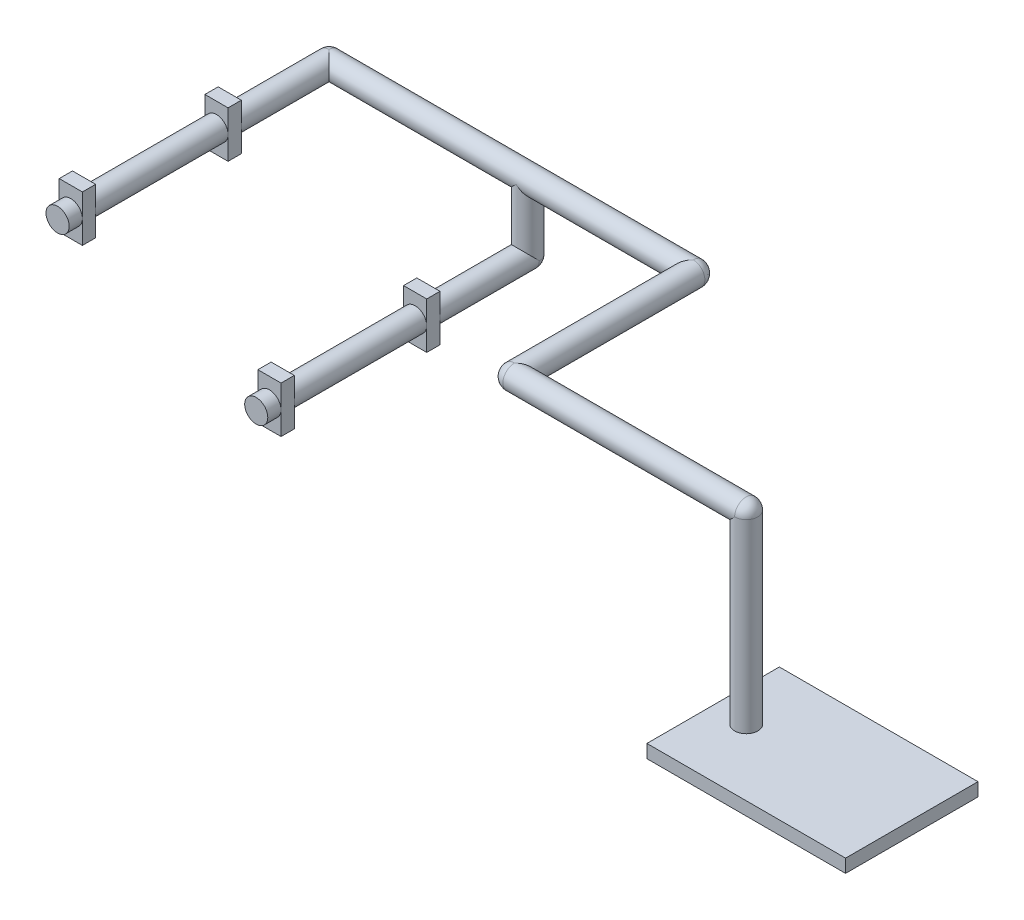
from build123d import *

# Parameters (mm, degrees)
EXTRUSION1_DEPTH      = 50
EXTRUSION1_DEPTH_BACK = 60
ESQUISSE1_R           = 3.5
ESQUISSE2_R           = 3.5
EXTRUSION2_DEPTH      = 20
ESQUISSE3_R           = 3.500016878
EXTRUSION3_DEPTH      = 30
ESQUISSE4_R           = 3.5
EXTRUSION4_DEPTH      = 30
ESQUISSE5_W           = 7
ESQUISSE5_H           = 14
EXTRUSION5_DEPTH      = 4
ESQUISSE6_R           = 3.5
EXTRUSION6_DEPTH      = 40
EXTRUSION7_DEPTH      = 4
ESQUISSE8_R           = 3.5
EXTRUSION8_DEPTH      = 4
ESQUISSE9_W           = 7
ESQUISSE9_H           = 14
EXTRUSION9_DEPTH      = 4
ESQUISSE10_R          = 3.489147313
EXTRUSION10_DEPTH     = 40
ESQUISSE11_W          = 7
ESQUISSE11_H          = 14
EXTRUSION11_DEPTH     = 4
ESQUISSE12_R          = 3.489147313
EXTRUSION12_DEPTH     = 4
ESQUISSE13_R          = 3.5
EXTRUSION13_DEPTH     = 54
ESQUISSE14_R          = 3.5
EXTRUSION14_DEPTH     = 70
ESQUISSE15_R          = 3.5
EXTRUSION15_DEPTH     = 56
ESQUISSE17_W          = 60
ESQUISSE17_H          = 40
EXTRUSION16_DEPTH     = 4


with BuildPart() as part:
    # Esquisse1 → Extrusion1 (new, two sides: drawn at the far end of the back side and taken through both)
    with BuildSketch(Plane(origin=(0, 0, 0), x_dir=(0, 0, -1), z_dir=(1, 0, 0)).offset(-EXTRUSION1_DEPTH_BACK)):
        Circle(ESQUISSE1_R)
    extrude(amount=EXTRUSION1_DEPTH + EXTRUSION1_DEPTH_BACK)

    # Esquisse2 → Extrusion2 (add)
    with BuildSketch(Plane(origin=(0, 0, 0), x_dir=(1, 0, 0), z_dir=(0, 1, 0))):
        with Locations(Location((0, 0, 0), (0, 0, 270))):
            Circle(ESQUISSE2_R)
    extrude(amount=-EXTRUSION2_DEPTH)

    # Esquisse3 → Extrusion3 (add)
    with BuildSketch(Plane.XY):
        with Locations(Location((0, -19.989130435, 0), (0, 0, 180.177936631))):
            Circle(ESQUISSE3_R)
    extrude(amount=EXTRUSION3_DEPTH)

    # Esquisse4 → Extrusion4 (add)
    with BuildSketch(Plane.XY):
        with Locations(Location((-60, 0, 0), (0, 0, 270))):
            Circle(ESQUISSE4_R)
    extrude(amount=EXTRUSION4_DEPTH)

    # Esquisse5 → Extrusion5 (add)
    with BuildSketch(Plane.XY.offset(30)):
        with Locations((-60, 0)):
            Rectangle(ESQUISSE5_W, ESQUISSE5_H)
    extrude(amount=EXTRUSION5_DEPTH)

    # Esquisse6 → Extrusion6 (add)
    with BuildSketch(Plane.XY.offset(34)):
        with Locations(Location((-60, 0, 0), (0, 0, 180))):
            Circle(ESQUISSE6_R)
    extrude(amount=EXTRUSION6_DEPTH)

    # Esquisse7 → Extrusion7 (add)
    with BuildSketch(Plane.XY.offset(74)):
        Polygon((-63.5, 0), (-63.5, -7), (-56.5, -7), (-56.5, 0), (-56.5, 7), (-63.5, 7), align=None)
    extrude(amount=EXTRUSION7_DEPTH)

    # Esquisse8 → Extrusion8 (add)
    with BuildSketch(Plane.XY.offset(78)):
        with Locations(Location((-60, 0, 0), (0, 0, 180))):
            Circle(ESQUISSE8_R)
    extrude(amount=EXTRUSION8_DEPTH)

    # Esquisse9 → Extrusion9 (add)
    with BuildSketch(Plane.XY.offset(30)):
        with Locations((0, -19.989130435)):
            Rectangle(ESQUISSE9_W, ESQUISSE9_H)
    extrude(amount=EXTRUSION9_DEPTH)

    # Esquisse10 → Extrusion10 (add)
    with BuildSketch(Plane.XY.offset(34)):
        with Locations((0, -20)):
            Circle(ESQUISSE10_R)
    extrude(amount=EXTRUSION10_DEPTH)

    # Esquisse11 → Extrusion11 (add)
    with BuildSketch(Plane.XY.offset(74)):
        with Locations((0, -19.989130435)):
            Rectangle(ESQUISSE11_W, ESQUISSE11_H)
    extrude(amount=EXTRUSION11_DEPTH)

    # Esquisse12 → Extrusion12 (add)
    with BuildSketch(Plane.XY.offset(78)):
        with Locations((0, -20)):
            Circle(ESQUISSE12_R)
    extrude(amount=EXTRUSION12_DEPTH)

    # Esquisse13 → Extrusion13 (add)
    with BuildSketch(Plane.XY):
        with Locations(Location((50, 0, 0), (0, 0, 90))):
            Circle(ESQUISSE13_R)
    extrude(amount=EXTRUSION13_DEPTH)

    # Esquisse14 → Extrusion14 (add)
    with BuildSketch(Plane(origin=(50, 0, 0), x_dir=(0, 0, -1), z_dir=(1, 0, 0))):
        with Locations(Location((-54, 0, 0), (0, 0, 270))):
            Circle(ESQUISSE14_R)
    extrude(amount=EXTRUSION14_DEPTH)

    # Esquisse15 → Extrusion15 (add)
    with BuildSketch(Plane(origin=(0, 0, 0), x_dir=(1, 0, 0), z_dir=(0, 1, 0))):
        with Locations(Location((120, -54, 0), (0, 0, 270))):
            Circle(ESQUISSE15_R)
    extrude(amount=-EXTRUSION15_DEPTH)

    # Esquisse17 → Extrusion16 (add)
    with BuildSketch(Plane.XZ.offset(56)):
        with Locations((140, 54)):
            Rectangle(ESQUISSE17_W, ESQUISSE17_H)
    extrude(amount=EXTRUSION16_DEPTH)

    # Esquisse18 → R_volution1 (revolve)
    with BuildSketch(Plane(origin=(0, 0, 0), x_dir=(-1, 0, 0), z_dir=(0, 1, 0))):
        with BuildLine():
            Line((-120, 50.5), (-120, 57.5))
            ThreePointArc((-120, 57.5), (-123.5, 54), (-120, 50.5))
        make_face()
    revolve(axis=Axis((120, 0, 41.680675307), (0, 0, 1)))

    # Esquisse19 → R_volution2 (revolve)
    with BuildSketch(Plane.ZY.offset(-50)):
        with BuildLine():
            Line((54, 3.5), (54, -3.5))
            ThreePointArc((54, -3.5), (57.5, 0), (54, 3.5))
        make_face()
    revolve(axis=Axis((50, 11.18003786, 54), (0, -1, 0)))

    # Esquisse20 → R_volution3 (revolve)
    with BuildSketch(Plane(origin=(0, 0, 0), x_dir=(-1, 0, 0), z_dir=(0, 0, -1))):
        with BuildLine():
            Line((-50, -3.5), (-50, 3.5))
            ThreePointArc((-50, 3.5), (-53.5, 0), (-50, -3.5))
        make_face()
    revolve(axis=Axis((50, -7.946339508, 0), (0, 1, 0)))

    # Esquisse21 → R_volution4 (revolve)
    with BuildSketch(Plane(origin=(0, 0, 0), x_dir=(-1, 0, 0), z_dir=(0, 0, -1))):
        with BuildLine():
            Line((3.5, -20), (-3.5, -20))
            ThreePointArc((-3.5, -20), (0, -23.489147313), (3.5, -20))
        make_face()
    revolve(axis=Axis((8.189234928, -20, 0), (-1, 0, 0)))

    # Esquisse22 → R_volution5 (revolve)
    with BuildSketch(Plane.ZY.offset(60)):
        with BuildLine():
            Line((0, -3.5), (0, 3.5))
            ThreePointArc((0, 3.5), (-3.5, 0), (0, -3.5))
        make_face()
    revolve(axis=Axis((-60, -6.605036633, 0), (0, 1, 0)))


solid = part.part
